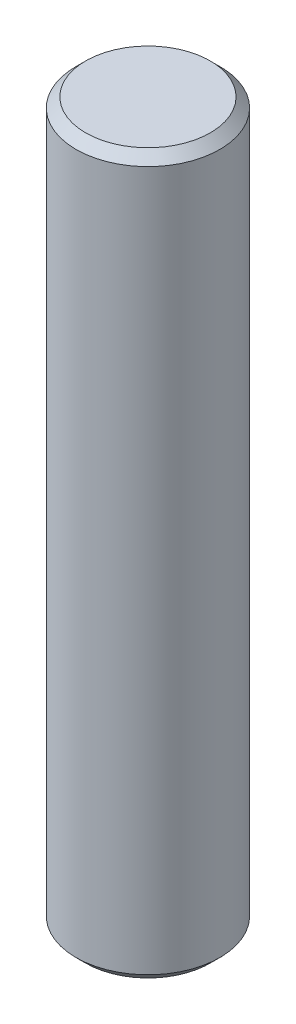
from build123d import *

# Parameters (mm, degrees)
SKETCH1_R           = 1.5
BOSS_EXTRUDE1_DEPTH = 15
CHAMFER1_SIZE       = 0.2


with BuildPart() as part:
    # Sketch1 → Boss-Extrude1 (new body)
    with BuildSketch(Plane(origin=(0, 0, 0), x_dir=(1, 0, 0), z_dir=(0, 1, 0))):
        with Locations(Location((0, 0, 0), (0, 0, 270))):
            Circle(SKETCH1_R)
    extrude(amount=BOSS_EXTRUDE1_DEPTH)

    # Chamfer1
    chamfer1_edges = [part.edges().sort_by_distance(p)[0] for p in [
        (0, 0, -1.5),
        (0, 15, -1.5),
    ]]
    chamfer(chamfer1_edges, length=CHAMFER1_SIZE)


solid = part.part
